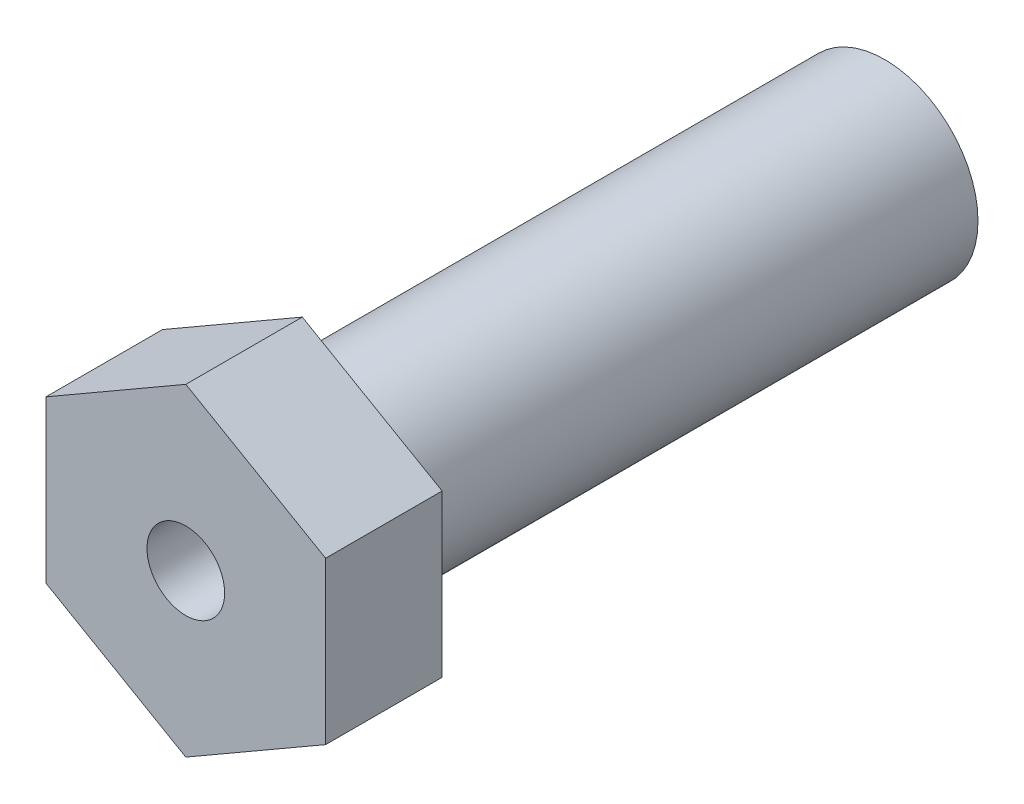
ISO-10303-21;
HEADER;
FILE_DESCRIPTION(('STEP AP214'),'2;1');
FILE_NAME('part.step','',(''),(''),'','','');
FILE_SCHEMA(('AUTOMOTIVE_DESIGN { 1 0 10303 214 1 1 1 1 }'));
ENDSEC;
DATA;
#1=APPLICATION_CONTEXT('core data for automotive mechanical design processes');
#2=APPLICATION_PROTOCOL_DEFINITION('international standard','automotive_design',2000,#1);
#3=PRODUCT_CONTEXT('',#1,'mechanical');
#4=PRODUCT('Part','Part','',(#3));
#5=PRODUCT_RELATED_PRODUCT_CATEGORY('part','',(#4));
#6=PRODUCT_DEFINITION_FORMATION('','',#4);
#7=PRODUCT_DEFINITION_CONTEXT('part definition',#1,'design');
#8=PRODUCT_DEFINITION('design','',#6,#7);
#9=PRODUCT_DEFINITION_SHAPE('','',#8);
#10=(LENGTH_UNIT() NAMED_UNIT(*) SI_UNIT(.MILLI.,.METRE.));
#11=(NAMED_UNIT(*) PLANE_ANGLE_UNIT() SI_UNIT($,.RADIAN.));
#12=(NAMED_UNIT(*) SI_UNIT($,.STERADIAN.) SOLID_ANGLE_UNIT());
#13=UNCERTAINTY_MEASURE_WITH_UNIT(LENGTH_MEASURE(1.E-05),#10,'distance_accuracy_value','');
#14=(GEOMETRIC_REPRESENTATION_CONTEXT(3) GLOBAL_UNCERTAINTY_ASSIGNED_CONTEXT((#13)) GLOBAL_UNIT_ASSIGNED_CONTEXT((#10,
#11,#12)) REPRESENTATION_CONTEXT('',''));
#15=CARTESIAN_POINT('',(0.,0.,0.));
#16=DIRECTION('',(0.,0.,1.));
#17=DIRECTION('',(1.,0.,0.));
#18=AXIS2_PLACEMENT_3D('',#15,#16,#17);
#19=CARTESIAN_POINT('',(0.,0.,78.));
#20=DIRECTION('',(0.,0.,1.));
#21=DIRECTION('',(1.,0.,0.));
#22=AXIS2_PLACEMENT_3D('',#19,#20,#21);
#23=PLANE('',#22);
#24=CARTESIAN_POINT('',(0.,0.,78.));
#25=DIRECTION('',(0.,0.,1.));
#26=DIRECTION('',(1.,0.,0.));
#27=AXIS2_PLACEMENT_3D('',#24,#25,#26);
#28=CIRCLE('',#27,5.);
#29=CARTESIAN_POINT('',(5.,0.,78.));
#30=VERTEX_POINT('',#29);
#31=EDGE_CURVE('E9',#30,#30,#28,.T.);
#32=ORIENTED_EDGE('',*,*,#31,.T.);
#33=EDGE_LOOP('',(#32));
#34=FACE_BOUND('',#33,.T.);
#35=ADVANCED_FACE('F14',(#34),#23,.T.);
#36=CARTESIAN_POINT('',(0.,0.,60.));
#37=DIRECTION('',(0.,0.,1.));
#38=DIRECTION('',(1.,0.,0.));
#39=AXIS2_PLACEMENT_3D('',#36,#37,#38);
#40=CYLINDRICAL_SURFACE('',#39,5.);
#41=CARTESIAN_POINT('',(0.,0.,90.));
#42=DIRECTION('',(0.,0.,1.));
#43=DIRECTION('',(1.,0.,0.));
#44=AXIS2_PLACEMENT_3D('',#41,#42,#43);
#45=CIRCLE('',#44,5.);
#46=CARTESIAN_POINT('',(5.,0.,90.));
#47=VERTEX_POINT('',#46);
#48=EDGE_CURVE('E21',#47,#47,#45,.T.);
#49=ORIENTED_EDGE('',*,*,#48,.T.);
#50=EDGE_LOOP('',(#49));
#51=FACE_BOUND('',#50,.T.);
#52=ORIENTED_EDGE('',*,*,#31,.F.);
#53=EDGE_LOOP('',(#52));
#54=FACE_BOUND('',#53,.T.);
#55=ADVANCED_FACE('F125',(#51,#54),#40,.F.);
#56=CARTESIAN_POINT('',(-5.,0.,90.));
#57=DIRECTION('',(0.,0.,1.));
#58=DIRECTION('',(1.,0.,0.));
#59=AXIS2_PLACEMENT_3D('',#56,#57,#58);
#60=PLANE('',#59);
#61=DIRECTION('',(-0.866025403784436,-0.5,0.));
#62=VECTOR('',#61,1.);
#63=CARTESIAN_POINT('',(18.,-10.3923048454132,90.));
#64=LINE('',#63,#62);
#65=CARTESIAN_POINT('',(18.,-10.3923048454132,90.));
#66=VERTEX_POINT('',#65);
#67=CARTESIAN_POINT('',(0.,-20.7846096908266,90.));
#68=VERTEX_POINT('',#67);
#69=EDGE_CURVE('E78',#66,#68,#64,.T.);
#70=ORIENTED_EDGE('',*,*,#69,.F.);
#71=DIRECTION('',(0.,1.,0.));
#72=VECTOR('',#71,1.);
#73=CARTESIAN_POINT('',(18.,-10.3923048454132,90.));
#74=LINE('',#73,#72);
#75=CARTESIAN_POINT('',(18.,10.3923048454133,90.));
#76=VERTEX_POINT('',#75);
#77=EDGE_CURVE('E109',#66,#76,#74,.T.);
#78=ORIENTED_EDGE('',*,*,#77,.T.);
#79=DIRECTION('',(-0.86602540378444,0.5,0.));
#80=VECTOR('',#79,1.);
#81=CARTESIAN_POINT('',(18.,10.3923048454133,90.));
#82=LINE('',#81,#80);
#83=CARTESIAN_POINT('',(0.,20.7846096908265,90.));
#84=VERTEX_POINT('',#83);
#85=EDGE_CURVE('E28',#76,#84,#82,.T.);
#86=ORIENTED_EDGE('',*,*,#85,.T.);
#87=DIRECTION('',(0.86602540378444,0.5,0.));
#88=VECTOR('',#87,1.);
#89=CARTESIAN_POINT('',(-18.,10.3923048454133,90.));
#90=LINE('',#89,#88);
#91=CARTESIAN_POINT('',(-18.,10.3923048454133,90.));
#92=VERTEX_POINT('',#91);
#93=EDGE_CURVE('E91',#92,#84,#90,.T.);
#94=ORIENTED_EDGE('',*,*,#93,.F.);
#95=DIRECTION('',(0.,1.,0.));
#96=VECTOR('',#95,1.);
#97=CARTESIAN_POINT('',(-18.,-10.3923048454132,90.));
#98=LINE('',#97,#96);
#99=CARTESIAN_POINT('',(-18.,-10.3923048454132,90.));
#100=VERTEX_POINT('',#99);
#101=EDGE_CURVE('E89',#100,#92,#98,.T.);
#102=ORIENTED_EDGE('',*,*,#101,.F.);
#103=DIRECTION('',(0.866025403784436,-0.5,0.));
#104=VECTOR('',#103,1.);
#105=CARTESIAN_POINT('',(-18.,-10.3923048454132,90.));
#106=LINE('',#105,#104);
#107=EDGE_CURVE('E70',#100,#68,#106,.T.);
#108=ORIENTED_EDGE('',*,*,#107,.T.);
#109=EDGE_LOOP('',(#70,#78,#86,#94,#102,#108));
#110=FACE_BOUND('',#109,.T.);
#111=ORIENTED_EDGE('',*,*,#48,.F.);
#112=EDGE_LOOP('',(#111));
#113=FACE_BOUND('',#112,.T.);
#114=ADVANCED_FACE('F85',(#110,#113),#60,.T.);
#115=CARTESIAN_POINT('',(18.,-10.3923048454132,75.));
#116=DIRECTION('',(-0.5,0.866025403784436,0.));
#117=DIRECTION('',(-0.866025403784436,-0.5,0.));
#118=AXIS2_PLACEMENT_3D('',#115,#116,#117);
#119=PLANE('',#118);
#120=DIRECTION('',(0.,0.,1.));
#121=VECTOR('',#120,1.);
#122=CARTESIAN_POINT('',(0.,-20.7846096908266,75.));
#123=LINE('',#122,#121);
#124=CARTESIAN_POINT('',(0.,-20.7846096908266,75.));
#125=VERTEX_POINT('',#124);
#126=EDGE_CURVE('E66',#125,#68,#123,.T.);
#127=ORIENTED_EDGE('',*,*,#126,.F.);
#128=DIRECTION('',(-0.866025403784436,-0.5,0.));
#129=VECTOR('',#128,1.);
#130=CARTESIAN_POINT('',(18.,-10.3923048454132,75.));
#131=LINE('',#130,#129);
#132=CARTESIAN_POINT('',(18.,-10.3923048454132,75.));
#133=VERTEX_POINT('',#132);
#134=EDGE_CURVE('E36',#133,#125,#131,.T.);
#135=ORIENTED_EDGE('',*,*,#134,.F.);
#136=DIRECTION('',(0.,0.,1.));
#137=VECTOR('',#136,1.);
#138=CARTESIAN_POINT('',(18.,-10.3923048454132,75.));
#139=LINE('',#138,#137);
#140=EDGE_CURVE('E80',#133,#66,#139,.T.);
#141=ORIENTED_EDGE('',*,*,#140,.T.);
#142=ORIENTED_EDGE('',*,*,#69,.T.);
#143=EDGE_LOOP('',(#127,#135,#141,#142));
#144=FACE_BOUND('',#143,.T.);
#145=ADVANCED_FACE('F79',(#144),#119,.F.);
#146=CARTESIAN_POINT('',(-18.,-10.3923048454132,75.));
#147=DIRECTION('',(-0.5,-0.866025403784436,0.));
#148=DIRECTION('',(0.866025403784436,-0.5,0.));
#149=AXIS2_PLACEMENT_3D('',#146,#147,#148);
#150=PLANE('',#149);
#151=DIRECTION('',(0.,0.,1.));
#152=VECTOR('',#151,1.);
#153=CARTESIAN_POINT('',(-18.,-10.3923048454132,75.));
#154=LINE('',#153,#152);
#155=CARTESIAN_POINT('',(-18.,-10.3923048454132,75.));
#156=VERTEX_POINT('',#155);
#157=EDGE_CURVE('E75',#156,#100,#154,.T.);
#158=ORIENTED_EDGE('',*,*,#157,.F.);
#159=DIRECTION('',(0.866025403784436,-0.5,0.));
#160=VECTOR('',#159,1.);
#161=CARTESIAN_POINT('',(-18.,-10.3923048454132,75.));
#162=LINE('',#161,#160);
#163=EDGE_CURVE('E73',#156,#125,#162,.T.);
#164=ORIENTED_EDGE('',*,*,#163,.T.);
#165=ORIENTED_EDGE('',*,*,#126,.T.);
#166=ORIENTED_EDGE('',*,*,#107,.F.);
#167=EDGE_LOOP('',(#158,#164,#165,#166));
#168=FACE_BOUND('',#167,.T.);
#169=ADVANCED_FACE('F68',(#168),#150,.T.);
#170=CARTESIAN_POINT('',(-18.,-10.3923048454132,75.));
#171=DIRECTION('',(1.,0.,0.));
#172=DIRECTION('',(0.,1.,0.));
#173=AXIS2_PLACEMENT_3D('',#170,#171,#172);
#174=PLANE('',#173);
#175=DIRECTION('',(0.,0.,1.));
#176=VECTOR('',#175,1.);
#177=CARTESIAN_POINT('',(-18.,10.3923048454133,75.));
#178=LINE('',#177,#176);
#179=CARTESIAN_POINT('',(-18.,10.3923048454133,75.));
#180=VERTEX_POINT('',#179);
#181=EDGE_CURVE('E115',#180,#92,#178,.T.);
#182=ORIENTED_EDGE('',*,*,#181,.F.);
#183=DIRECTION('',(0.,1.,0.));
#184=VECTOR('',#183,1.);
#185=CARTESIAN_POINT('',(-18.,-10.3923048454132,75.));
#186=LINE('',#185,#184);
#187=EDGE_CURVE('E104',#156,#180,#186,.T.);
#188=ORIENTED_EDGE('',*,*,#187,.F.);
#189=ORIENTED_EDGE('',*,*,#157,.T.);
#190=ORIENTED_EDGE('',*,*,#101,.T.);
#191=EDGE_LOOP('',(#182,#188,#189,#190));
#192=FACE_BOUND('',#191,.T.);
#193=ADVANCED_FACE('F173',(#192),#174,.F.);
#194=CARTESIAN_POINT('',(-18.,10.3923048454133,75.));
#195=DIRECTION('',(0.5,-0.86602540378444,0.));
#196=DIRECTION('',(0.86602540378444,0.5,0.));
#197=AXIS2_PLACEMENT_3D('',#194,#195,#196);
#198=PLANE('',#197);
#199=DIRECTION('',(0.,0.,1.));
#200=VECTOR('',#199,1.);
#201=CARTESIAN_POINT('',(0.,20.7846096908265,75.));
#202=LINE('',#201,#200);
#203=CARTESIAN_POINT('',(0.,20.7846096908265,75.));
#204=VERTEX_POINT('',#203);
#205=EDGE_CURVE('E113',#204,#84,#202,.T.);
#206=ORIENTED_EDGE('',*,*,#205,.F.);
#207=DIRECTION('',(0.86602540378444,0.5,0.));
#208=VECTOR('',#207,1.);
#209=CARTESIAN_POINT('',(-18.,10.3923048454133,75.));
#210=LINE('',#209,#208);
#211=EDGE_CURVE('E101',#180,#204,#210,.T.);
#212=ORIENTED_EDGE('',*,*,#211,.F.);
#213=ORIENTED_EDGE('',*,*,#181,.T.);
#214=ORIENTED_EDGE('',*,*,#93,.T.);
#215=EDGE_LOOP('',(#206,#212,#213,#214));
#216=FACE_BOUND('',#215,.T.);
#217=ADVANCED_FACE('F180',(#216),#198,.F.);
#218=CARTESIAN_POINT('',(18.,10.3923048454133,75.));
#219=DIRECTION('',(0.5,0.86602540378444,0.));
#220=DIRECTION('',(-0.86602540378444,0.5,0.));
#221=AXIS2_PLACEMENT_3D('',#218,#219,#220);
#222=PLANE('',#221);
#223=DIRECTION('',(0.,0.,1.));
#224=VECTOR('',#223,1.);
#225=CARTESIAN_POINT('',(18.,10.3923048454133,75.));
#226=LINE('',#225,#224);
#227=CARTESIAN_POINT('',(18.,10.3923048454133,75.));
#228=VERTEX_POINT('',#227);
#229=EDGE_CURVE('E111',#228,#76,#226,.T.);
#230=ORIENTED_EDGE('',*,*,#229,.F.);
#231=DIRECTION('',(-0.86602540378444,0.5,0.));
#232=VECTOR('',#231,1.);
#233=CARTESIAN_POINT('',(18.,10.3923048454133,75.));
#234=LINE('',#233,#232);
#235=EDGE_CURVE('E98',#228,#204,#234,.T.);
#236=ORIENTED_EDGE('',*,*,#235,.T.);
#237=ORIENTED_EDGE('',*,*,#205,.T.);
#238=ORIENTED_EDGE('',*,*,#85,.F.);
#239=EDGE_LOOP('',(#230,#236,#237,#238));
#240=FACE_BOUND('',#239,.T.);
#241=ADVANCED_FACE('F189',(#240),#222,.T.);
#242=CARTESIAN_POINT('',(18.,-10.3923048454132,75.));
#243=DIRECTION('',(1.,0.,0.));
#244=DIRECTION('',(0.,1.,0.));
#245=AXIS2_PLACEMENT_3D('',#242,#243,#244);
#246=PLANE('',#245);
#247=DIRECTION('',(0.,1.,0.));
#248=VECTOR('',#247,1.);
#249=CARTESIAN_POINT('',(18.,-10.3923048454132,75.));
#250=LINE('',#249,#248);
#251=EDGE_CURVE('E95',#133,#228,#250,.T.);
#252=ORIENTED_EDGE('',*,*,#251,.T.);
#253=ORIENTED_EDGE('',*,*,#229,.T.);
#254=ORIENTED_EDGE('',*,*,#77,.F.);
#255=ORIENTED_EDGE('',*,*,#140,.F.);
#256=EDGE_LOOP('',(#252,#253,#254,#255));
#257=FACE_BOUND('',#256,.T.);
#258=ADVANCED_FACE('F198',(#257),#246,.T.);
#259=CARTESIAN_POINT('',(-12.,0.,0.));
#260=DIRECTION('',(0.,0.,-1.));
#261=DIRECTION('',(-1.,0.,0.));
#262=AXIS2_PLACEMENT_3D('',#259,#260,#261);
#263=PLANE('',#262);
#264=CARTESIAN_POINT('',(0.,0.,0.));
#265=DIRECTION('',(0.,0.,1.));
#266=DIRECTION('',(1.,0.,0.));
#267=AXIS2_PLACEMENT_3D('',#264,#265,#266);
#268=CIRCLE('',#267,12.);
#269=CARTESIAN_POINT('',(12.,0.,0.));
#270=VERTEX_POINT('',#269);
#271=EDGE_CURVE('E74',#270,#270,#268,.T.);
#272=ORIENTED_EDGE('',*,*,#271,.F.);
#273=EDGE_LOOP('',(#272));
#274=FACE_BOUND('',#273,.T.);
#275=ADVANCED_FACE('F206',(#274),#263,.T.);
#276=CARTESIAN_POINT('',(0.,0.,60.));
#277=DIRECTION('',(0.,0.,1.));
#278=DIRECTION('',(1.,0.,0.));
#279=AXIS2_PLACEMENT_3D('',#276,#277,#278);
#280=CYLINDRICAL_SURFACE('',#279,12.);
#281=ORIENTED_EDGE('',*,*,#271,.T.);
#282=EDGE_LOOP('',(#281));
#283=FACE_BOUND('',#282,.T.);
#284=CARTESIAN_POINT('',(0.,0.,75.));
#285=DIRECTION('',(0.,0.,1.));
#286=DIRECTION('',(1.,0.,0.));
#287=AXIS2_PLACEMENT_3D('',#284,#285,#286);
#288=CIRCLE('',#287,12.);
#289=CARTESIAN_POINT('',(12.,0.,75.));
#290=VERTEX_POINT('',#289);
#291=EDGE_CURVE('E120',#290,#290,#288,.T.);
#292=ORIENTED_EDGE('',*,*,#291,.F.);
#293=EDGE_LOOP('',(#292));
#294=FACE_BOUND('',#293,.T.);
#295=ADVANCED_FACE('F215',(#283,#294),#280,.T.);
#296=CARTESIAN_POINT('',(-22.,0.,75.));
#297=DIRECTION('',(0.,0.,-1.));
#298=DIRECTION('',(-1.,0.,0.));
#299=AXIS2_PLACEMENT_3D('',#296,#297,#298);
#300=PLANE('',#299);
#301=ORIENTED_EDGE('',*,*,#134,.T.);
#302=ORIENTED_EDGE('',*,*,#163,.F.);
#303=ORIENTED_EDGE('',*,*,#187,.T.);
#304=ORIENTED_EDGE('',*,*,#211,.T.);
#305=ORIENTED_EDGE('',*,*,#235,.F.);
#306=ORIENTED_EDGE('',*,*,#251,.F.);
#307=EDGE_LOOP('',(#301,#302,#303,#304,#305,#306));
#308=FACE_BOUND('',#307,.T.);
#309=ORIENTED_EDGE('',*,*,#291,.T.);
#310=EDGE_LOOP('',(#309));
#311=FACE_BOUND('',#310,.T.);
#312=ADVANCED_FACE('F224',(#308,#311),#300,.T.);
#313=CLOSED_SHELL('',(#35,#55,#114,#145,#169,#193,#217,#241,#258,#275,#295,#312));
#314=MANIFOLD_SOLID_BREP('B1',#313);
#315=ADVANCED_BREP_SHAPE_REPRESENTATION('',(#18,#314),#14);
#316=SHAPE_DEFINITION_REPRESENTATION(#9,#315);
ENDSEC;
END-ISO-10303-21;
